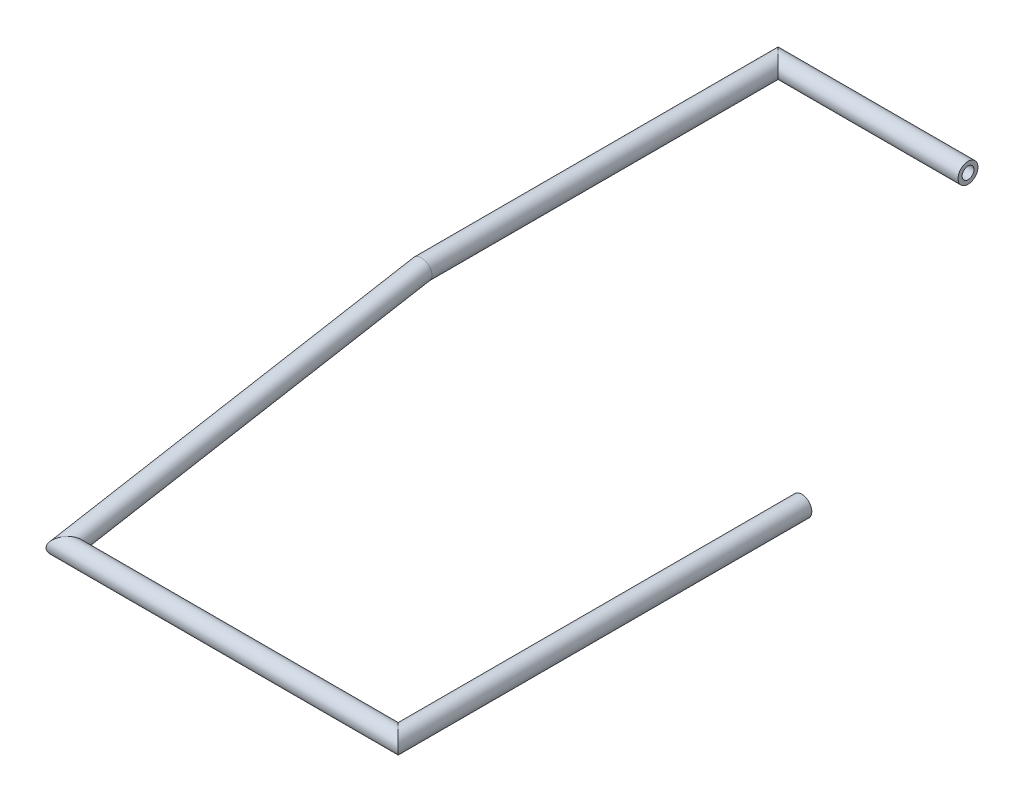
from build123d import *

# Parameters (mm, degrees)
SKETCH3_R   = 10.668
SKETCH3_R_2 = 6.35


with BuildPart() as part:
    # Sweep1: sweep along a curve in space
    with BuildLine() as sweep1_path:
        Line((0, 2165.865043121, 0), (0, 2165.865043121, 431.8))
        Line((0, 2165.865043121, 431.8), (-355.6, 2165.865043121, 431.8))
        Line((-355.6, 2165.865043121, 431.8), (-355.6, 2233.045622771, 50.8))
        Line((-355.6, 2233.045622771, 50.8), (-355.6, 2233.045622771, -330.2))
        Line((-355.6, 2233.045622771, -330.2), (-152.4, 2233.045622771, -330.2))
    # Sketch3 → Sweep1 (sweep)
    with BuildSketch(Plane.XY):
        with Locations((0, 2165.865043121)):
            Circle(SKETCH3_R)
        with Locations((0, 2165.865043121)):
            Circle(SKETCH3_R_2, mode=Mode.SUBTRACT)
    sweep(path=sweep1_path.line, transition=Transition.RIGHT)


solid = part.part
